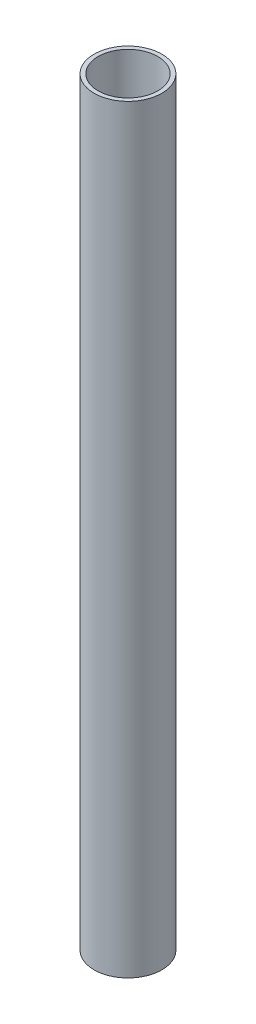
from build123d import *

# Parameters (mm, degrees)
SKETCH_1_R      = 25
SKETCH_1_R_2    = 22
EXTRUDE_1_DEPTH = 560


with BuildPart() as part:
    # Sketch 1 → Extrude 1 (new body)
    with BuildSketch(Plane(origin=(0, 0, 0), x_dir=(1, 0, 0), z_dir=(0, 1, 0))):
        with Locations(Location((0, 0, 0), (0, 0, 270))):
            Circle(SKETCH_1_R)
        with Locations(Location((0, 0, 0), (0, 0, 270))):
            Circle(SKETCH_1_R_2, mode=Mode.SUBTRACT)
    extrude(amount=EXTRUDE_1_DEPTH)


solid = part.part
